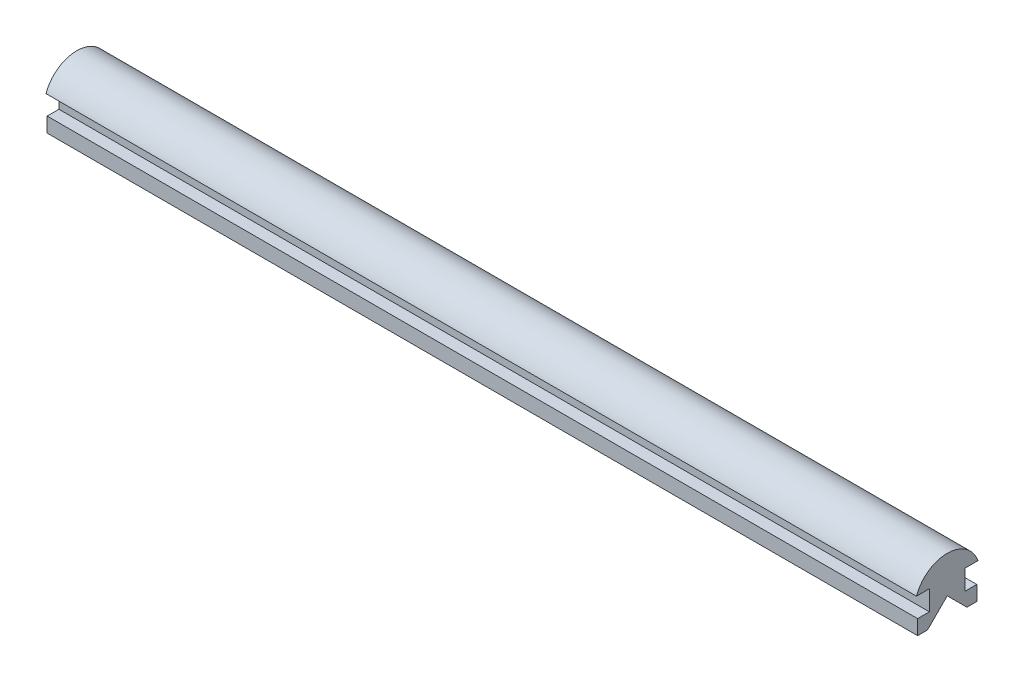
ISO-10303-21;
HEADER;
FILE_DESCRIPTION(('STEP AP214'),'2;1');
FILE_NAME('part.step','',(''),(''),'','','');
FILE_SCHEMA(('AUTOMOTIVE_DESIGN { 1 0 10303 214 1 1 1 1 }'));
ENDSEC;
DATA;
#1=APPLICATION_CONTEXT('core data for automotive mechanical design processes');
#2=APPLICATION_PROTOCOL_DEFINITION('international standard','automotive_design',2000,#1);
#3=PRODUCT_CONTEXT('',#1,'mechanical');
#4=PRODUCT('Part','Part','',(#3));
#5=PRODUCT_RELATED_PRODUCT_CATEGORY('part','',(#4));
#6=PRODUCT_DEFINITION_FORMATION('','',#4);
#7=PRODUCT_DEFINITION_CONTEXT('part definition',#1,'design');
#8=PRODUCT_DEFINITION('design','',#6,#7);
#9=PRODUCT_DEFINITION_SHAPE('','',#8);
#10=(LENGTH_UNIT() NAMED_UNIT(*) SI_UNIT(.MILLI.,.METRE.));
#11=(NAMED_UNIT(*) PLANE_ANGLE_UNIT() SI_UNIT($,.RADIAN.));
#12=(NAMED_UNIT(*) SI_UNIT($,.STERADIAN.) SOLID_ANGLE_UNIT());
#13=UNCERTAINTY_MEASURE_WITH_UNIT(LENGTH_MEASURE(1.E-05),#10,'distance_accuracy_value','');
#14=(GEOMETRIC_REPRESENTATION_CONTEXT(3) GLOBAL_UNCERTAINTY_ASSIGNED_CONTEXT((#13)) GLOBAL_UNIT_ASSIGNED_CONTEXT((#10,
#11,#12)) REPRESENTATION_CONTEXT('',''));
#15=CARTESIAN_POINT('',(0.,0.,0.));
#16=DIRECTION('',(0.,0.,1.));
#17=DIRECTION('',(1.,0.,0.));
#18=AXIS2_PLACEMENT_3D('',#15,#16,#17);
#19=CARTESIAN_POINT('',(200.,-2.77223698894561,3.96889479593));
#20=DIRECTION('',(0.,-1.,0.));
#21=DIRECTION('',(0.,0.,-1.));
#22=AXIS2_PLACEMENT_3D('',#19,#20,#21);
#23=PLANE('',#22);
#24=DIRECTION('',(0.,0.,1.));
#25=VECTOR('',#24,1.);
#26=CARTESIAN_POINT('',(0.,-2.77223698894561,3.96889479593));
#27=LINE('',#26,#25);
#28=CARTESIAN_POINT('',(0.,-2.77223698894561,3.96889479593));
#29=VERTEX_POINT('',#28);
#30=CARTESIAN_POINT('',(0.,-2.77223698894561,6.66889479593));
#31=VERTEX_POINT('',#30);
#32=EDGE_CURVE('E222',#29,#31,#27,.T.);
#33=ORIENTED_EDGE('',*,*,#32,.T.);
#34=DIRECTION('',(-1.,0.,0.));
#35=VECTOR('',#34,1.);
#36=CARTESIAN_POINT('',(200.,-2.77223698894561,6.66889479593));
#37=LINE('',#36,#35);
#38=CARTESIAN_POINT('',(200.,-2.77223698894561,6.66889479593));
#39=VERTEX_POINT('',#38);
#40=EDGE_CURVE('E13',#39,#31,#37,.T.);
#41=ORIENTED_EDGE('',*,*,#40,.F.);
#42=DIRECTION('',(0.,0.,1.));
#43=VECTOR('',#42,1.);
#44=CARTESIAN_POINT('',(200.,-2.77223698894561,3.96889479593));
#45=LINE('',#44,#43);
#46=CARTESIAN_POINT('',(200.,-2.77223698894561,3.96889479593));
#47=VERTEX_POINT('',#46);
#48=EDGE_CURVE('E259',#47,#39,#45,.T.);
#49=ORIENTED_EDGE('',*,*,#48,.F.);
#50=DIRECTION('',(-1.,0.,0.));
#51=VECTOR('',#50,1.);
#52=CARTESIAN_POINT('',(200.,-2.77223698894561,3.96889479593));
#53=LINE('',#52,#51);
#54=EDGE_CURVE('E218',#47,#29,#53,.T.);
#55=ORIENTED_EDGE('',*,*,#54,.T.);
#56=EDGE_LOOP('',(#33,#41,#49,#55));
#57=FACE_BOUND('',#56,.T.);
#58=ADVANCED_FACE('F91',(#57),#23,.F.);
#59=CARTESIAN_POINT('',(200.,-2.77223698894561,6.66889479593));
#60=DIRECTION('',(0.,0.,-1.));
#61=DIRECTION('',(-1.,0.,0.));
#62=AXIS2_PLACEMENT_3D('',#59,#60,#61);
#63=PLANE('',#62);
#64=DIRECTION('',(0.,-1.,0.));
#65=VECTOR('',#64,1.);
#66=CARTESIAN_POINT('',(0.,-2.77223698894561,6.66889479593));
#67=LINE('',#66,#65);
#68=CARTESIAN_POINT('',(0.,-6.17223698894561,6.66889479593));
#69=VERTEX_POINT('',#68);
#70=EDGE_CURVE('E226',#31,#69,#67,.T.);
#71=ORIENTED_EDGE('',*,*,#70,.T.);
#72=DIRECTION('',(-1.,0.,0.));
#73=VECTOR('',#72,1.);
#74=CARTESIAN_POINT('',(200.,-6.17223698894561,6.66889479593));
#75=LINE('',#74,#73);
#76=CARTESIAN_POINT('',(200.,-6.17223698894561,6.66889479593));
#77=VERTEX_POINT('',#76);
#78=EDGE_CURVE('E100',#77,#69,#75,.T.);
#79=ORIENTED_EDGE('',*,*,#78,.F.);
#80=DIRECTION('',(0.,-1.,0.));
#81=VECTOR('',#80,1.);
#82=CARTESIAN_POINT('',(200.,-2.77223698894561,6.66889479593));
#83=LINE('',#82,#81);
#84=EDGE_CURVE('E166',#39,#77,#83,.T.);
#85=ORIENTED_EDGE('',*,*,#84,.F.);
#86=ORIENTED_EDGE('',*,*,#40,.T.);
#87=EDGE_LOOP('',(#71,#79,#85,#86));
#88=FACE_BOUND('',#87,.T.);
#89=ADVANCED_FACE('F360',(#88),#63,.F.);
#90=CARTESIAN_POINT('',(200.,-6.17223698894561,6.66889479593));
#91=DIRECTION('',(0.,1.,0.));
#92=DIRECTION('',(0.,0.,1.));
#93=AXIS2_PLACEMENT_3D('',#90,#91,#92);
#94=PLANE('',#93);
#95=DIRECTION('',(0.,0.,-1.));
#96=VECTOR('',#95,1.);
#97=CARTESIAN_POINT('',(0.,-6.17223698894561,6.66889479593));
#98=LINE('',#97,#96);
#99=CARTESIAN_POINT('',(0.,-6.17223698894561,4.39732191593));
#100=VERTEX_POINT('',#99);
#101=EDGE_CURVE('E229',#69,#100,#98,.T.);
#102=ORIENTED_EDGE('',*,*,#101,.T.);
#103=DIRECTION('',(-1.,0.,0.));
#104=VECTOR('',#103,1.);
#105=CARTESIAN_POINT('',(200.,-6.17223698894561,4.39732191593));
#106=LINE('',#105,#104);
#107=CARTESIAN_POINT('',(200.,-6.17223698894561,4.39732191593));
#108=VERTEX_POINT('',#107);
#109=EDGE_CURVE('E290',#108,#100,#106,.T.);
#110=ORIENTED_EDGE('',*,*,#109,.F.);
#111=DIRECTION('',(0.,0.,-1.));
#112=VECTOR('',#111,1.);
#113=CARTESIAN_POINT('',(200.,-6.17223698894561,6.66889479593));
#114=LINE('',#113,#112);
#115=EDGE_CURVE('E300',#77,#108,#114,.T.);
#116=ORIENTED_EDGE('',*,*,#115,.F.);
#117=ORIENTED_EDGE('',*,*,#78,.T.);
#118=EDGE_LOOP('',(#102,#110,#116,#117));
#119=FACE_BOUND('',#118,.T.);
#120=ADVANCED_FACE('F298',(#119),#94,.F.);
#121=CARTESIAN_POINT('',(200.,-6.17223698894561,4.39732191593));
#122=DIRECTION('',(0.,0.707106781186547,0.707106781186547));
#123=DIRECTION('',(0.,-0.707106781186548,0.707106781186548));
#124=AXIS2_PLACEMENT_3D('',#121,#122,#123);
#125=PLANE('',#124);
#126=DIRECTION('',(0.,0.707106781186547,-0.707106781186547));
#127=VECTOR('',#126,1.);
#128=CARTESIAN_POINT('',(0.,-6.17223698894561,4.39732191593));
#129=LINE('',#128,#127);
#130=CARTESIAN_POINT('',(0.,-1.64380986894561,-0.131105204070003));
#131=VERTEX_POINT('',#130);
#132=EDGE_CURVE('E232',#100,#131,#129,.T.);
#133=ORIENTED_EDGE('',*,*,#132,.T.);
#134=DIRECTION('',(-1.,0.,0.));
#135=VECTOR('',#134,1.);
#136=CARTESIAN_POINT('',(200.,-1.64380986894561,-0.131105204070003));
#137=LINE('',#136,#135);
#138=CARTESIAN_POINT('',(200.,-1.64380986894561,-0.131105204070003));
#139=VERTEX_POINT('',#138);
#140=EDGE_CURVE('E286',#139,#131,#137,.T.);
#141=ORIENTED_EDGE('',*,*,#140,.F.);
#142=DIRECTION('',(0.,0.707106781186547,-0.707106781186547));
#143=VECTOR('',#142,1.);
#144=CARTESIAN_POINT('',(200.,-6.17223698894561,4.39732191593));
#145=LINE('',#144,#143);
#146=EDGE_CURVE('E319',#108,#139,#145,.T.);
#147=ORIENTED_EDGE('',*,*,#146,.F.);
#148=ORIENTED_EDGE('',*,*,#109,.T.);
#149=EDGE_LOOP('',(#133,#141,#147,#148));
#150=FACE_BOUND('',#149,.T.);
#151=ADVANCED_FACE('F309',(#150),#125,.F.);
#152=CARTESIAN_POINT('',(200.,-1.64380986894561,-0.131105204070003));
#153=DIRECTION('',(0.,0.707106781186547,-0.707106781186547));
#154=DIRECTION('',(0.,0.707106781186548,0.707106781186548));
#155=AXIS2_PLACEMENT_3D('',#152,#153,#154);
#156=PLANE('',#155);
#157=DIRECTION('',(0.,-0.707106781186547,-0.707106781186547));
#158=VECTOR('',#157,1.);
#159=CARTESIAN_POINT('',(0.,-1.64380986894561,-0.131105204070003));
#160=LINE('',#159,#158);
#161=CARTESIAN_POINT('',(0.,-6.17223698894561,-4.65953232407));
#162=VERTEX_POINT('',#161);
#163=EDGE_CURVE('E235',#131,#162,#160,.T.);
#164=ORIENTED_EDGE('',*,*,#163,.T.);
#165=DIRECTION('',(-1.,0.,0.));
#166=VECTOR('',#165,1.);
#167=CARTESIAN_POINT('',(200.,-6.17223698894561,-4.65953232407));
#168=LINE('',#167,#166);
#169=CARTESIAN_POINT('',(200.,-6.17223698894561,-4.65953232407));
#170=VERTEX_POINT('',#169);
#171=EDGE_CURVE('E282',#170,#162,#168,.T.);
#172=ORIENTED_EDGE('',*,*,#171,.F.);
#173=DIRECTION('',(0.,-0.707106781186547,-0.707106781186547));
#174=VECTOR('',#173,1.);
#175=CARTESIAN_POINT('',(200.,-1.64380986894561,-0.131105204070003));
#176=LINE('',#175,#174);
#177=EDGE_CURVE('E315',#139,#170,#176,.T.);
#178=ORIENTED_EDGE('',*,*,#177,.F.);
#179=ORIENTED_EDGE('',*,*,#140,.T.);
#180=EDGE_LOOP('',(#164,#172,#178,#179));
#181=FACE_BOUND('',#180,.T.);
#182=ADVANCED_FACE('F313',(#181),#156,.F.);
#183=CARTESIAN_POINT('',(200.,-6.17223698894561,-4.65953232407));
#184=DIRECTION('',(0.,1.,0.));
#185=DIRECTION('',(0.,0.,1.));
#186=AXIS2_PLACEMENT_3D('',#183,#184,#185);
#187=PLANE('',#186);
#188=DIRECTION('',(0.,0.,-1.));
#189=VECTOR('',#188,1.);
#190=CARTESIAN_POINT('',(0.,-6.17223698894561,-4.65953232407));
#191=LINE('',#190,#189);
#192=CARTESIAN_POINT('',(0.,-6.17223698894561,-6.93110520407));
#193=VERTEX_POINT('',#192);
#194=EDGE_CURVE('E238',#162,#193,#191,.T.);
#195=ORIENTED_EDGE('',*,*,#194,.T.);
#196=DIRECTION('',(-1.,0.,0.));
#197=VECTOR('',#196,1.);
#198=CARTESIAN_POINT('',(200.,-6.17223698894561,-6.93110520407));
#199=LINE('',#198,#197);
#200=CARTESIAN_POINT('',(200.,-6.17223698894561,-6.93110520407));
#201=VERTEX_POINT('',#200);
#202=EDGE_CURVE('E278',#201,#193,#199,.T.);
#203=ORIENTED_EDGE('',*,*,#202,.F.);
#204=DIRECTION('',(0.,0.,-1.));
#205=VECTOR('',#204,1.);
#206=CARTESIAN_POINT('',(200.,-6.17223698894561,-4.65953232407));
#207=LINE('',#206,#205);
#208=EDGE_CURVE('E318',#170,#201,#207,.T.);
#209=ORIENTED_EDGE('',*,*,#208,.F.);
#210=ORIENTED_EDGE('',*,*,#171,.T.);
#211=EDGE_LOOP('',(#195,#203,#209,#210));
#212=FACE_BOUND('',#211,.T.);
#213=ADVANCED_FACE('F373',(#212),#187,.F.);
#214=CARTESIAN_POINT('',(200.,-6.17223698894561,-6.93110520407));
#215=DIRECTION('',(0.,0.,1.));
#216=DIRECTION('',(1.,0.,0.));
#217=AXIS2_PLACEMENT_3D('',#214,#215,#216);
#218=PLANE('',#217);
#219=DIRECTION('',(0.,1.,0.));
#220=VECTOR('',#219,1.);
#221=CARTESIAN_POINT('',(0.,-6.17223698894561,-6.93110520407));
#222=LINE('',#221,#220);
#223=CARTESIAN_POINT('',(0.,-2.77223698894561,-6.93110520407));
#224=VERTEX_POINT('',#223);
#225=EDGE_CURVE('E241',#193,#224,#222,.T.);
#226=ORIENTED_EDGE('',*,*,#225,.T.);
#227=DIRECTION('',(-1.,0.,0.));
#228=VECTOR('',#227,1.);
#229=CARTESIAN_POINT('',(200.,-2.77223698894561,-6.93110520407));
#230=LINE('',#229,#228);
#231=CARTESIAN_POINT('',(200.,-2.77223698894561,-6.93110520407));
#232=VERTEX_POINT('',#231);
#233=EDGE_CURVE('E274',#232,#224,#230,.T.);
#234=ORIENTED_EDGE('',*,*,#233,.F.);
#235=DIRECTION('',(0.,1.,0.));
#236=VECTOR('',#235,1.);
#237=CARTESIAN_POINT('',(200.,-6.17223698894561,-6.93110520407));
#238=LINE('',#237,#236);
#239=EDGE_CURVE('E323',#201,#232,#238,.T.);
#240=ORIENTED_EDGE('',*,*,#239,.F.);
#241=ORIENTED_EDGE('',*,*,#202,.T.);
#242=EDGE_LOOP('',(#226,#234,#240,#241));
#243=FACE_BOUND('',#242,.T.);
#244=ADVANCED_FACE('F376',(#243),#218,.F.);
#245=CARTESIAN_POINT('',(200.,-2.77223698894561,-6.93110520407));
#246=DIRECTION('',(0.,-1.,0.));
#247=DIRECTION('',(0.,0.,-1.));
#248=AXIS2_PLACEMENT_3D('',#245,#246,#247);
#249=PLANE('',#248);
#250=DIRECTION('',(0.,0.,1.));
#251=VECTOR('',#250,1.);
#252=CARTESIAN_POINT('',(0.,-2.77223698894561,-6.93110520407));
#253=LINE('',#252,#251);
#254=CARTESIAN_POINT('',(0.,-2.77223698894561,-4.23110520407));
#255=VERTEX_POINT('',#254);
#256=EDGE_CURVE('E244',#224,#255,#253,.T.);
#257=ORIENTED_EDGE('',*,*,#256,.T.);
#258=DIRECTION('',(-1.,0.,0.));
#259=VECTOR('',#258,1.);
#260=CARTESIAN_POINT('',(200.,-2.77223698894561,-4.23110520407));
#261=LINE('',#260,#259);
#262=CARTESIAN_POINT('',(200.,-2.77223698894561,-4.23110520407));
#263=VERTEX_POINT('',#262);
#264=EDGE_CURVE('E270',#263,#255,#261,.T.);
#265=ORIENTED_EDGE('',*,*,#264,.F.);
#266=DIRECTION('',(0.,0.,1.));
#267=VECTOR('',#266,1.);
#268=CARTESIAN_POINT('',(200.,-2.77223698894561,-6.93110520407));
#269=LINE('',#268,#267);
#270=EDGE_CURVE('E330',#232,#263,#269,.T.);
#271=ORIENTED_EDGE('',*,*,#270,.F.);
#272=ORIENTED_EDGE('',*,*,#233,.T.);
#273=EDGE_LOOP('',(#257,#265,#271,#272));
#274=FACE_BOUND('',#273,.T.);
#275=ADVANCED_FACE('F380',(#274),#249,.F.);
#276=CARTESIAN_POINT('',(200.,-2.77223698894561,-4.23110520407));
#277=DIRECTION('',(0.,0.,1.));
#278=DIRECTION('',(1.,0.,0.));
#279=AXIS2_PLACEMENT_3D('',#276,#277,#278);
#280=PLANE('',#279);
#281=DIRECTION('',(0.,1.,0.));
#282=VECTOR('',#281,1.);
#283=CARTESIAN_POINT('',(0.,-2.77223698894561,-4.23110520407));
#284=LINE('',#283,#282);
#285=CARTESIAN_POINT('',(0.,1.82776301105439,-4.23110520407));
#286=VERTEX_POINT('',#285);
#287=EDGE_CURVE('E247',#255,#286,#284,.T.);
#288=ORIENTED_EDGE('',*,*,#287,.T.);
#289=DIRECTION('',(-1.,0.,0.));
#290=VECTOR('',#289,1.);
#291=CARTESIAN_POINT('',(200.,1.82776301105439,-4.23110520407));
#292=LINE('',#291,#290);
#293=CARTESIAN_POINT('',(200.,1.82776301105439,-4.23110520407));
#294=VERTEX_POINT('',#293);
#295=EDGE_CURVE('E266',#294,#286,#292,.T.);
#296=ORIENTED_EDGE('',*,*,#295,.F.);
#297=DIRECTION('',(0.,1.,0.));
#298=VECTOR('',#297,1.);
#299=CARTESIAN_POINT('',(200.,-2.77223698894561,-4.23110520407));
#300=LINE('',#299,#298);
#301=EDGE_CURVE('E333',#263,#294,#300,.T.);
#302=ORIENTED_EDGE('',*,*,#301,.F.);
#303=ORIENTED_EDGE('',*,*,#264,.T.);
#304=EDGE_LOOP('',(#288,#296,#302,#303));
#305=FACE_BOUND('',#304,.T.);
#306=ADVANCED_FACE('F341',(#305),#280,.F.);
#307=CARTESIAN_POINT('',(200.,1.82776301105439,-4.23110520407));
#308=DIRECTION('',(0.,1.,0.));
#309=DIRECTION('',(0.,0.,1.));
#310=AXIS2_PLACEMENT_3D('',#307,#308,#309);
#311=PLANE('',#310);
#312=DIRECTION('',(0.,0.,-1.));
#313=VECTOR('',#312,1.);
#314=CARTESIAN_POINT('',(0.,1.82776301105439,-4.23110520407));
#315=LINE('',#314,#313);
#316=CARTESIAN_POINT('',(0.,1.82776301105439,-7.20217301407));
#317=VERTEX_POINT('',#316);
#318=EDGE_CURVE('E250',#286,#317,#315,.T.);
#319=ORIENTED_EDGE('',*,*,#318,.T.);
#320=DIRECTION('',(-1.,0.,0.));
#321=VECTOR('',#320,1.);
#322=CARTESIAN_POINT('',(200.,1.82776301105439,-7.20217301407));
#323=LINE('',#322,#321);
#324=CARTESIAN_POINT('',(200.,1.82776301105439,-7.20217301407));
#325=VERTEX_POINT('',#324);
#326=EDGE_CURVE('E211',#325,#317,#323,.T.);
#327=ORIENTED_EDGE('',*,*,#326,.F.);
#328=DIRECTION('',(0.,0.,-1.));
#329=VECTOR('',#328,1.);
#330=CARTESIAN_POINT('',(200.,1.82776301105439,-4.23110520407));
#331=LINE('',#330,#329);
#332=EDGE_CURVE('E200',#294,#325,#331,.T.);
#333=ORIENTED_EDGE('',*,*,#332,.F.);
#334=ORIENTED_EDGE('',*,*,#295,.T.);
#335=EDGE_LOOP('',(#319,#327,#333,#334));
#336=FACE_BOUND('',#335,.T.);
#337=ADVANCED_FACE('F345',(#336),#311,.F.);
#338=CARTESIAN_POINT('',(200.,-0.672236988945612,-0.131105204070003));
#339=DIRECTION('',(-1.,0.,0.));
#340=DIRECTION('',(0.,0.,1.));
#341=AXIS2_PLACEMENT_3D('',#338,#339,#340);
#342=CYLINDRICAL_SURFACE('',#341,7.49999999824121);
#343=CARTESIAN_POINT('',(0.,-0.672236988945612,-0.131105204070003));
#344=DIRECTION('',(1.,0.,0.));
#345=DIRECTION('',(0.,0.,-1.));
#346=AXIS2_PLACEMENT_3D('',#343,#344,#345);
#347=CIRCLE('',#346,7.49999999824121);
#348=CARTESIAN_POINT('',(0.,1.82776301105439,6.93996260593));
#349=VERTEX_POINT('',#348);
#350=EDGE_CURVE('E209',#317,#349,#347,.T.);
#351=ORIENTED_EDGE('',*,*,#350,.T.);
#352=DIRECTION('',(-1.,0.,0.));
#353=VECTOR('',#352,1.);
#354=CARTESIAN_POINT('',(200.,1.82776301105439,6.93996260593));
#355=LINE('',#354,#353);
#356=CARTESIAN_POINT('',(200.,1.82776301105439,6.93996260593));
#357=VERTEX_POINT('',#356);
#358=EDGE_CURVE('E206',#357,#349,#355,.T.);
#359=ORIENTED_EDGE('',*,*,#358,.F.);
#360=CARTESIAN_POINT('',(200.,-0.672236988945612,-0.131105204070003));
#361=DIRECTION('',(1.,0.,0.));
#362=DIRECTION('',(0.,0.,-1.));
#363=AXIS2_PLACEMENT_3D('',#360,#361,#362);
#364=CIRCLE('',#363,7.49999999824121);
#365=EDGE_CURVE('E194',#325,#357,#364,.T.);
#366=ORIENTED_EDGE('',*,*,#365,.F.);
#367=ORIENTED_EDGE('',*,*,#326,.T.);
#368=EDGE_LOOP('',(#351,#359,#366,#367));
#369=FACE_BOUND('',#368,.T.);
#370=ADVANCED_FACE('F207',(#369),#342,.T.);
#371=CARTESIAN_POINT('',(200.,1.82776301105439,6.93996260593));
#372=DIRECTION('',(0.,1.,0.));
#373=DIRECTION('',(0.,0.,1.));
#374=AXIS2_PLACEMENT_3D('',#371,#372,#373);
#375=PLANE('',#374);
#376=DIRECTION('',(0.,0.,-1.));
#377=VECTOR('',#376,1.);
#378=CARTESIAN_POINT('',(0.,1.82776301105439,6.93996260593));
#379=LINE('',#378,#377);
#380=CARTESIAN_POINT('',(0.,1.82776301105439,3.96889479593));
#381=VERTEX_POINT('',#380);
#382=EDGE_CURVE('E152',#349,#381,#379,.T.);
#383=ORIENTED_EDGE('',*,*,#382,.T.);
#384=DIRECTION('',(-1.,0.,0.));
#385=VECTOR('',#384,1.);
#386=CARTESIAN_POINT('',(200.,1.82776301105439,3.96889479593));
#387=LINE('',#386,#385);
#388=CARTESIAN_POINT('',(200.,1.82776301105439,3.96889479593));
#389=VERTEX_POINT('',#388);
#390=EDGE_CURVE('E212',#389,#381,#387,.T.);
#391=ORIENTED_EDGE('',*,*,#390,.F.);
#392=DIRECTION('',(0.,0.,-1.));
#393=VECTOR('',#392,1.);
#394=CARTESIAN_POINT('',(200.,1.82776301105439,6.93996260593));
#395=LINE('',#394,#393);
#396=EDGE_CURVE('E198',#357,#389,#395,.T.);
#397=ORIENTED_EDGE('',*,*,#396,.F.);
#398=ORIENTED_EDGE('',*,*,#358,.T.);
#399=EDGE_LOOP('',(#383,#391,#397,#398));
#400=FACE_BOUND('',#399,.T.);
#401=ADVANCED_FACE('F214',(#400),#375,.F.);
#402=CARTESIAN_POINT('',(200.,1.82776301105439,3.96889479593));
#403=DIRECTION('',(0.,0.,-1.));
#404=DIRECTION('',(-1.,0.,0.));
#405=AXIS2_PLACEMENT_3D('',#402,#403,#404);
#406=PLANE('',#405);
#407=DIRECTION('',(0.,-1.,0.));
#408=VECTOR('',#407,1.);
#409=CARTESIAN_POINT('',(0.,1.82776301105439,3.96889479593));
#410=LINE('',#409,#408);
#411=EDGE_CURVE('E158',#381,#29,#410,.T.);
#412=ORIENTED_EDGE('',*,*,#411,.T.);
#413=ORIENTED_EDGE('',*,*,#54,.F.);
#414=DIRECTION('',(0.,-1.,0.));
#415=VECTOR('',#414,1.);
#416=CARTESIAN_POINT('',(200.,1.82776301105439,3.96889479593));
#417=LINE('',#416,#415);
#418=EDGE_CURVE('E108',#389,#47,#417,.T.);
#419=ORIENTED_EDGE('',*,*,#418,.F.);
#420=ORIENTED_EDGE('',*,*,#390,.T.);
#421=EDGE_LOOP('',(#412,#413,#419,#420));
#422=FACE_BOUND('',#421,.T.);
#423=ADVANCED_FACE('F349',(#422),#406,.F.);
#424=CARTESIAN_POINT('',(200.,-0.672236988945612,-0.131105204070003));
#425=DIRECTION('',(1.,0.,0.));
#426=DIRECTION('',(0.,0.,-1.));
#427=AXIS2_PLACEMENT_3D('',#424,#425,#426);
#428=PLANE('',#427);
#429=ORIENTED_EDGE('',*,*,#48,.T.);
#430=ORIENTED_EDGE('',*,*,#84,.T.);
#431=ORIENTED_EDGE('',*,*,#115,.T.);
#432=ORIENTED_EDGE('',*,*,#146,.T.);
#433=ORIENTED_EDGE('',*,*,#177,.T.);
#434=ORIENTED_EDGE('',*,*,#208,.T.);
#435=ORIENTED_EDGE('',*,*,#239,.T.);
#436=ORIENTED_EDGE('',*,*,#270,.T.);
#437=ORIENTED_EDGE('',*,*,#301,.T.);
#438=ORIENTED_EDGE('',*,*,#332,.T.);
#439=ORIENTED_EDGE('',*,*,#365,.T.);
#440=ORIENTED_EDGE('',*,*,#396,.T.);
#441=ORIENTED_EDGE('',*,*,#418,.T.);
#442=EDGE_LOOP('',(#429,#430,#431,#432,#433,#434,#435,#436,#437,#438,#439,#440,#441));
#443=FACE_BOUND('',#442,.T.);
#444=ADVANCED_FACE('F196',(#443),#428,.T.);
#445=CARTESIAN_POINT('',(0.,-0.672236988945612,-0.131105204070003));
#446=DIRECTION('',(1.,0.,0.));
#447=DIRECTION('',(0.,0.,-1.));
#448=AXIS2_PLACEMENT_3D('',#445,#446,#447);
#449=PLANE('',#448);
#450=ORIENTED_EDGE('',*,*,#32,.F.);
#451=ORIENTED_EDGE('',*,*,#411,.F.);
#452=ORIENTED_EDGE('',*,*,#382,.F.);
#453=ORIENTED_EDGE('',*,*,#350,.F.);
#454=ORIENTED_EDGE('',*,*,#318,.F.);
#455=ORIENTED_EDGE('',*,*,#287,.F.);
#456=ORIENTED_EDGE('',*,*,#256,.F.);
#457=ORIENTED_EDGE('',*,*,#225,.F.);
#458=ORIENTED_EDGE('',*,*,#194,.F.);
#459=ORIENTED_EDGE('',*,*,#163,.F.);
#460=ORIENTED_EDGE('',*,*,#132,.F.);
#461=ORIENTED_EDGE('',*,*,#101,.F.);
#462=ORIENTED_EDGE('',*,*,#70,.F.);
#463=EDGE_LOOP('',(#450,#451,#452,#453,#454,#455,#456,#457,#458,#459,#460,#461,#462));
#464=FACE_BOUND('',#463,.T.);
#465=ADVANCED_FACE('F304',(#464),#449,.F.);
#466=CLOSED_SHELL('',(#58,#89,#120,#151,#182,#213,#244,#275,#306,#337,#370,#401,#423,#444,#465));
#467=MANIFOLD_SOLID_BREP('B2',#466);
#468=ADVANCED_BREP_SHAPE_REPRESENTATION('',(#18,#467),#14);
#469=SHAPE_DEFINITION_REPRESENTATION(#9,#468);
ENDSEC;
END-ISO-10303-21;
